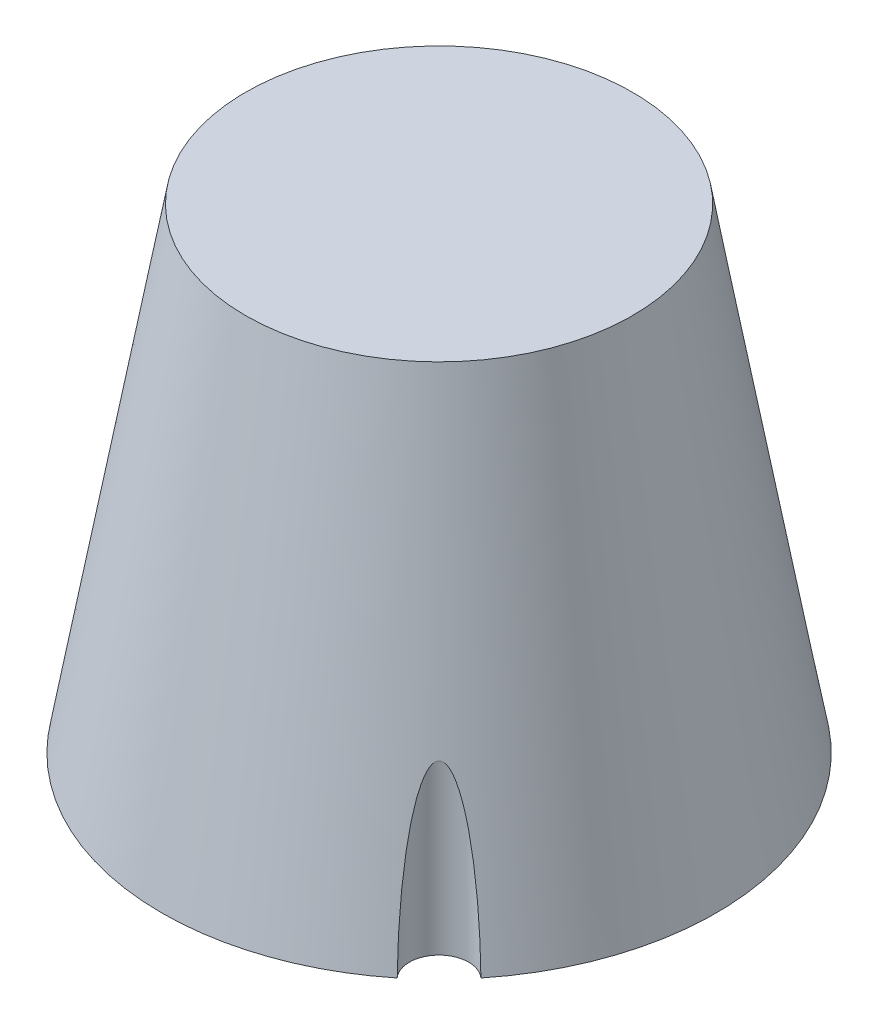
from build123d import *

# Parameters (mm, degrees)
SKETCH1_R          = 35
EXTRUDE1_DEPTH     = 60
EXTRUDE1_TAPER     = 10
SKETCH3_R          = 3.7415497
CUT_EXTRUDE1_DEPTH = 60


with BuildPart() as part:
    # Sketch1 → Extrude1 (new body)
    with BuildSketch(Plane(origin=(0, 0, 0), x_dir=(1, 0, 0), z_dir=(0, 1, 0))):
        Circle(SKETCH1_R)
    extrude(amount=EXTRUDE1_DEPTH, taper=EXTRUDE1_TAPER)

    # Sketch3 → Cut-Extrude1 (cut)
    with BuildSketch(Plane.XZ):
        with Locations((24.748737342, 24.748737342)):
            Circle(SKETCH3_R)
    extrude(amount=-CUT_EXTRUDE1_DEPTH, mode=Mode.SUBTRACT)


solid = part.part
